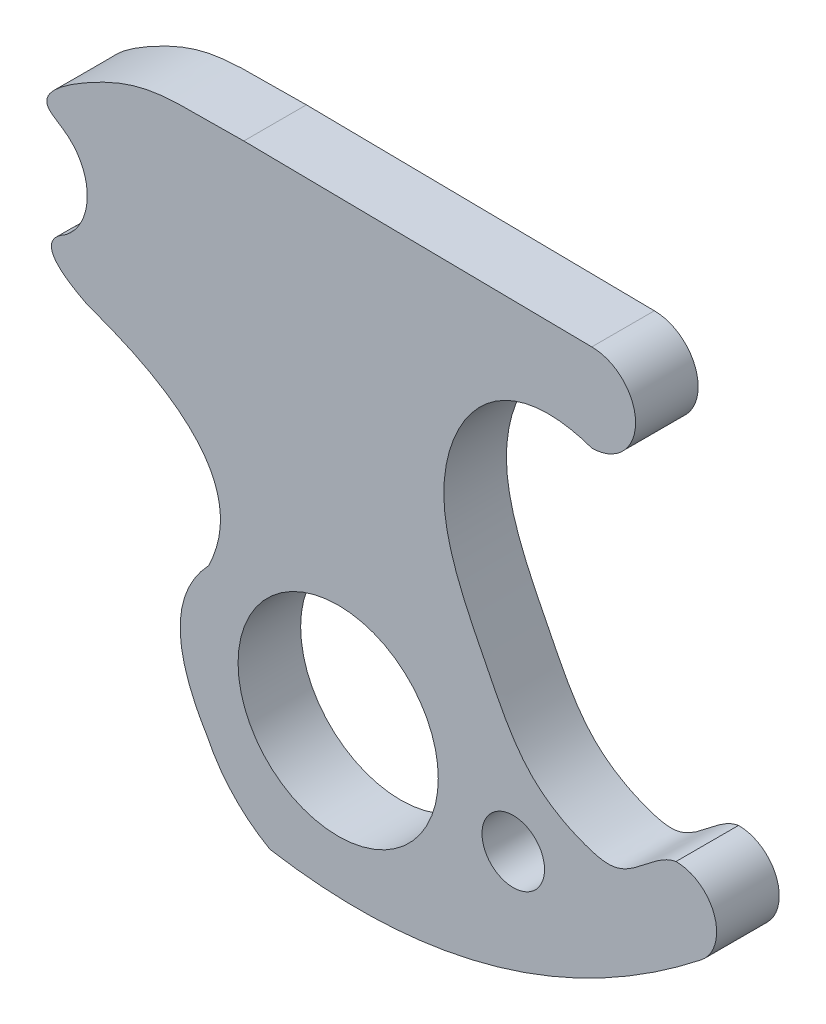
ISO-10303-21;
HEADER;
FILE_DESCRIPTION(('STEP AP214'),'2;1');
FILE_NAME('part.step','',(''),(''),'','','');
FILE_SCHEMA(('AUTOMOTIVE_DESIGN { 1 0 10303 214 1 1 1 1 }'));
ENDSEC;
DATA;
#1=APPLICATION_CONTEXT('core data for automotive mechanical design processes');
#2=APPLICATION_PROTOCOL_DEFINITION('international standard','automotive_design',2000,#1);
#3=PRODUCT_CONTEXT('',#1,'mechanical');
#4=PRODUCT('Part','Part','',(#3));
#5=PRODUCT_RELATED_PRODUCT_CATEGORY('part','',(#4));
#6=PRODUCT_DEFINITION_FORMATION('','',#4);
#7=PRODUCT_DEFINITION_CONTEXT('part definition',#1,'design');
#8=PRODUCT_DEFINITION('design','',#6,#7);
#9=PRODUCT_DEFINITION_SHAPE('','',#8);
#10=(LENGTH_UNIT() NAMED_UNIT(*) SI_UNIT(.MILLI.,.METRE.));
#11=(NAMED_UNIT(*) PLANE_ANGLE_UNIT() SI_UNIT($,.RADIAN.));
#12=(NAMED_UNIT(*) SI_UNIT($,.STERADIAN.) SOLID_ANGLE_UNIT());
#13=UNCERTAINTY_MEASURE_WITH_UNIT(LENGTH_MEASURE(1.E-05),#10,'distance_accuracy_value','');
#14=(GEOMETRIC_REPRESENTATION_CONTEXT(3) GLOBAL_UNCERTAINTY_ASSIGNED_CONTEXT((#13)) GLOBAL_UNIT_ASSIGNED_CONTEXT((#10,
#11,#12)) REPRESENTATION_CONTEXT('',''));
#15=CARTESIAN_POINT('',(0.,0.,0.));
#16=DIRECTION('',(0.,0.,1.));
#17=DIRECTION('',(1.,0.,0.));
#18=AXIS2_PLACEMENT_3D('',#15,#16,#17);
#19=CARTESIAN_POINT('',(-20.7514285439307,33.7227240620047,5.));
#20=DIRECTION('',(0.,0.,-1.));
#21=DIRECTION('',(-1.,0.,0.));
#22=AXIS2_PLACEMENT_3D('',#19,#20,#21);
#23=PLANE('',#22);
#24=CARTESIAN_POINT('',(0.,0.,5.));
#25=DIRECTION('',(0.,0.,1.));
#26=DIRECTION('',(1.,0.,0.));
#27=AXIS2_PLACEMENT_3D('',#24,#25,#26);
#28=CIRCLE('',#27,8.);
#29=CARTESIAN_POINT('',(8.,0.,5.));
#30=VERTEX_POINT('',#29);
#31=EDGE_CURVE('E221',#30,#30,#28,.T.);
#32=ORIENTED_EDGE('',*,*,#31,.F.);
#33=EDGE_LOOP('',(#32));
#34=FACE_BOUND('',#33,.T.);
#35=CARTESIAN_POINT('',(20.2655854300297,36.,5.));
#36=CARTESIAN_POINT('',(-7.53876863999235,36.3506294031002,5.));
#37=B_SPLINE_CURVE_WITH_KNOTS('',1,(#35,#36),.UNSPECIFIED.,.F.,.F.,(2,2),(0.,1.),.UNSPECIFIED.);
#38=CARTESIAN_POINT('',(20.2655854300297,36.,5.));
#39=VERTEX_POINT('',#38);
#40=CARTESIAN_POINT('',(-7.53876863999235,36.3506294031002,5.));
#41=VERTEX_POINT('',#40);
#42=EDGE_CURVE('E208',#39,#41,#37,.T.);
#43=ORIENTED_EDGE('',*,*,#42,.T.);
#44=CARTESIAN_POINT('',(-7.53876863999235,36.3506294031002,5.));
#45=CARTESIAN_POINT('',(-13.2526858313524,36.2026563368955,5.));
#46=CARTESIAN_POINT('',(-15.9308623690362,37.0656871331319,5.));
#47=CARTESIAN_POINT('',(-24.5833501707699,31.2786402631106,5.));
#48=CARTESIAN_POINT('',(-19.440600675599,28.8280088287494,5.));
#49=CARTESIAN_POINT('',(-19.513412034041,24.5035922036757,5.));
#50=CARTESIAN_POINT('',(-21.7529579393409,22.759510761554,5.));
#51=B_SPLINE_CURVE_WITH_KNOTS('',3,(#44,#45,#46,#47,#48,#49,#50),.UNSPECIFIED.,.F.,.F.,(4,1,1,1,
4),(0.,0.477306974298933,0.644600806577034,0.710818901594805,1.),.UNSPECIFIED.);
#52=CARTESIAN_POINT('',(-21.7529579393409,22.759510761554,5.));
#53=VERTEX_POINT('',#52);
#54=EDGE_CURVE('E99',#41,#53,#51,.T.);
#55=ORIENTED_EDGE('',*,*,#54,.T.);
#56=CARTESIAN_POINT('',(-21.7529579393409,22.759510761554,5.));
#57=CARTESIAN_POINT('',(-24.7413724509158,21.1377309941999,5.));
#58=CARTESIAN_POINT('',(-20.0526321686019,18.7686088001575,5.));
#59=B_SPLINE_CURVE_WITH_KNOTS('',2,(#56,#57,#58),.UNSPECIFIED.,.F.,.F.,(3,3),(0.,1.),.UNSPECIFIED.);
#60=CARTESIAN_POINT('',(-20.0526321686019,18.7686088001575,5.));
#61=VERTEX_POINT('',#60);
#62=EDGE_CURVE('E197',#53,#61,#59,.T.);
#63=ORIENTED_EDGE('',*,*,#62,.T.);
#64=CARTESIAN_POINT('',(-20.0526321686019,18.7686088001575,5.));
#65=CARTESIAN_POINT('',(-6.23194443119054,13.9479070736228,5.));
#66=CARTESIAN_POINT('',(-10.3537135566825,5.55269025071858,5.));
#67=B_SPLINE_CURVE_WITH_KNOTS('',2,(#64,#65,#66),.UNSPECIFIED.,.F.,.F.,(3,3),(0.,1.),.UNSPECIFIED.);
#68=CARTESIAN_POINT('',(-10.3537135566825,5.55269025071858,5.));
#69=VERTEX_POINT('',#68);
#70=EDGE_CURVE('E176',#61,#69,#67,.T.);
#71=ORIENTED_EDGE('',*,*,#70,.T.);
#72=CARTESIAN_POINT('',(-10.3537135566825,5.55269025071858,5.));
#73=CARTESIAN_POINT('',(-14.8367710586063,0.798292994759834,5.));
#74=CARTESIAN_POINT('',(-10.4719420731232,-6.29607386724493,5.));
#75=B_SPLINE_CURVE_WITH_KNOTS('',2,(#72,#73,#74),.UNSPECIFIED.,.F.,.F.,(3,3),(0.,1.),.UNSPECIFIED.);
#76=CARTESIAN_POINT('',(-10.4719420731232,-6.29607386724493,5.));
#77=VERTEX_POINT('',#76);
#78=EDGE_CURVE('E171',#69,#77,#75,.T.);
#79=ORIENTED_EDGE('',*,*,#78,.T.);
#80=CARTESIAN_POINT('',(0.500000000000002,-0.999999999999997,5.));
#81=DIRECTION('',(0.,0.,1.));
#82=DIRECTION('',(1.,0.,0.));
#83=AXIS2_PLACEMENT_3D('',#80,#81,#82);
#84=CIRCLE('',#83,12.1832635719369);
#85=CARTESIAN_POINT('',(-5.44066062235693,-11.6367505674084,5.));
#86=VERTEX_POINT('',#85);
#87=EDGE_CURVE('E166',#77,#86,#84,.T.);
#88=ORIENTED_EDGE('',*,*,#87,.T.);
#89=CARTESIAN_POINT('',(-5.44066062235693,-11.6367505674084,5.));
#90=CARTESIAN_POINT('',(12.9558635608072,-14.7021529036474,5.));
#91=CARTESIAN_POINT('',(28.9868345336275,-2.06837865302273,5.));
#92=B_SPLINE_CURVE_WITH_KNOTS('',2,(#89,#90,#91),.UNSPECIFIED.,.F.,.F.,(3,3),(0.,1.),.UNSPECIFIED.);
#93=CARTESIAN_POINT('',(28.9868345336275,-2.06837865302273,5.));
#94=VERTEX_POINT('',#93);
#95=EDGE_CURVE('E124',#86,#94,#92,.T.);
#96=ORIENTED_EDGE('',*,*,#95,.T.);
#97=CARTESIAN_POINT('',(26.9953699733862,0.5,5.));
#98=DIRECTION('',(0.,0.,1.));
#99=DIRECTION('',(1.,0.,0.));
#100=AXIS2_PLACEMENT_3D('',#97,#98,#99);
#101=CIRCLE('',#100,3.25);
#102=CARTESIAN_POINT('',(26.9953699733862,3.75,5.));
#103=VERTEX_POINT('',#102);
#104=EDGE_CURVE('E118',#94,#103,#101,.T.);
#105=ORIENTED_EDGE('',*,*,#104,.T.);
#106=CARTESIAN_POINT('',(26.9953699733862,3.75,5.));
#107=CARTESIAN_POINT('',(25.2656343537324,3.44699120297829,5.));
#108=CARTESIAN_POINT('',(23.2438230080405,0.258914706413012,5.));
#109=CARTESIAN_POINT('',(18.8506980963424,1.4608168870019,5.));
#110=CARTESIAN_POINT('',(14.7677667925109,3.81757658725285,5.));
#111=CARTESIAN_POINT('',(11.3342761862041,10.8582013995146,5.));
#112=CARTESIAN_POINT('',(5.65270933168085,21.587135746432,5.));
#113=CARTESIAN_POINT('',(12.8123683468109,31.6080154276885,5.));
#114=CARTESIAN_POINT('',(20.2655854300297,29.,5.));
#115=B_SPLINE_CURVE_WITH_KNOTS('',3,(#106,#107,#108,#109,#110,#111,#112,#113,#114),
.UNSPECIFIED.,.F.,.F.,(4,1,1,1,1,1,4),(0.,0.121513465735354,0.169898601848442,0.270902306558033,
0.413829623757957,0.654507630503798,1.),.UNSPECIFIED.);
#116=CARTESIAN_POINT('',(20.2655854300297,29.,5.));
#117=VERTEX_POINT('',#116);
#118=EDGE_CURVE('E122',#103,#117,#115,.T.);
#119=ORIENTED_EDGE('',*,*,#118,.T.);
#120=CARTESIAN_POINT('',(20.2655854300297,32.5,5.));
#121=DIRECTION('',(0.,0.,1.));
#122=DIRECTION('',(1.,0.,0.));
#123=AXIS2_PLACEMENT_3D('',#120,#121,#122);
#124=CIRCLE('',#123,3.5);
#125=EDGE_CURVE('E50',#117,#39,#124,.T.);
#126=ORIENTED_EDGE('',*,*,#125,.T.);
#127=EDGE_LOOP('',(#43,#55,#63,#71,#79,#88,#96,#105,#119,#126));
#128=FACE_BOUND('',#127,.T.);
#129=CARTESIAN_POINT('',(13.9913439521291,-2.05968308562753,5.));
#130=DIRECTION('',(0.,0.,1.));
#131=DIRECTION('',(1.,0.,0.));
#132=AXIS2_PLACEMENT_3D('',#129,#130,#131);
#133=CIRCLE('',#132,2.5);
#134=CARTESIAN_POINT('',(16.4913439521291,-2.05968308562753,5.));
#135=VERTEX_POINT('',#134);
#136=EDGE_CURVE('E225',#135,#135,#133,.T.);
#137=ORIENTED_EDGE('',*,*,#136,.F.);
#138=EDGE_LOOP('',(#137));
#139=FACE_BOUND('',#138,.T.);
#140=ADVANCED_FACE('F32',(#34,#128,#139),#23,.F.);
#141=CARTESIAN_POINT('',(-20.7514285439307,33.7227240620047,0.));
#142=DIRECTION('',(0.,0.,-1.));
#143=DIRECTION('',(-1.,0.,0.));
#144=AXIS2_PLACEMENT_3D('',#141,#142,#143);
#145=PLANE('',#144);
#146=CARTESIAN_POINT('',(13.9913439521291,-2.05968308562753,0.));
#147=DIRECTION('',(0.,0.,-1.));
#148=DIRECTION('',(-1.,0.,0.));
#149=AXIS2_PLACEMENT_3D('',#146,#147,#148);
#150=CIRCLE('',#149,2.5);
#151=CARTESIAN_POINT('',(11.4913439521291,-2.05968308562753,0.));
#152=VERTEX_POINT('',#151);
#153=EDGE_CURVE('E36',#152,#152,#150,.T.);
#154=ORIENTED_EDGE('',*,*,#153,.F.);
#155=EDGE_LOOP('',(#154));
#156=FACE_BOUND('',#155,.T.);
#157=CARTESIAN_POINT('',(20.2655854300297,36.,0.));
#158=CARTESIAN_POINT('',(-7.53876863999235,36.3506294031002,0.));
#159=B_SPLINE_CURVE_WITH_KNOTS('',1,(#157,#158),.UNSPECIFIED.,.F.,.F.,(2,2),(0.,1.),.UNSPECIFIED.);
#160=CARTESIAN_POINT('',(20.2655854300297,36.,0.));
#161=VERTEX_POINT('',#160);
#162=CARTESIAN_POINT('',(-7.53876863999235,36.3506294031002,0.));
#163=VERTEX_POINT('',#162);
#164=EDGE_CURVE('E224',#161,#163,#159,.T.);
#165=ORIENTED_EDGE('',*,*,#164,.F.);
#166=CARTESIAN_POINT('',(20.2655854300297,32.5,0.));
#167=DIRECTION('',(0.,0.,1.));
#168=DIRECTION('',(1.,0.,0.));
#169=AXIS2_PLACEMENT_3D('',#166,#167,#168);
#170=CIRCLE('',#169,3.5);
#171=CARTESIAN_POINT('',(20.2655854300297,29.,0.));
#172=VERTEX_POINT('',#171);
#173=EDGE_CURVE('E91',#172,#161,#170,.T.);
#174=ORIENTED_EDGE('',*,*,#173,.F.);
#175=CARTESIAN_POINT('',(26.9953699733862,3.75,0.));
#176=CARTESIAN_POINT('',(25.2656343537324,3.44699120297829,0.));
#177=CARTESIAN_POINT('',(23.2438230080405,0.258914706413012,0.));
#178=CARTESIAN_POINT('',(18.8506980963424,1.4608168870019,0.));
#179=CARTESIAN_POINT('',(14.7677667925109,3.81757658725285,0.));
#180=CARTESIAN_POINT('',(11.3342761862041,10.8582013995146,0.));
#181=CARTESIAN_POINT('',(5.65270933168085,21.587135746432,0.));
#182=CARTESIAN_POINT('',(12.8123683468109,31.6080154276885,0.));
#183=CARTESIAN_POINT('',(20.2655854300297,29.,0.));
#184=B_SPLINE_CURVE_WITH_KNOTS('',3,(#175,#176,#177,#178,#179,#180,#181,#182,#183),
.UNSPECIFIED.,.F.,.F.,(4,1,1,1,1,1,4),(0.,0.121513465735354,0.169898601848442,0.270902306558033,
0.413829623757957,0.654507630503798,1.),.UNSPECIFIED.);
#185=CARTESIAN_POINT('',(26.9953699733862,3.75,0.));
#186=VERTEX_POINT('',#185);
#187=EDGE_CURVE('E85',#186,#172,#184,.T.);
#188=ORIENTED_EDGE('',*,*,#187,.F.);
#189=CARTESIAN_POINT('',(26.9953699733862,0.5,0.));
#190=DIRECTION('',(0.,0.,1.));
#191=DIRECTION('',(1.,0.,0.));
#192=AXIS2_PLACEMENT_3D('',#189,#190,#191);
#193=CIRCLE('',#192,3.25);
#194=CARTESIAN_POINT('',(28.9868345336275,-2.06837865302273,0.));
#195=VERTEX_POINT('',#194);
#196=EDGE_CURVE('E132',#195,#186,#193,.T.);
#197=ORIENTED_EDGE('',*,*,#196,.F.);
#198=CARTESIAN_POINT('',(-5.44066062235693,-11.6367505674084,0.));
#199=CARTESIAN_POINT('',(12.9558635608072,-14.7021529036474,0.));
#200=CARTESIAN_POINT('',(28.9868345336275,-2.06837865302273,0.));
#201=B_SPLINE_CURVE_WITH_KNOTS('',2,(#198,#199,#200),.UNSPECIFIED.,.F.,.F.,(3,3),(0.,1.),.UNSPECIFIED.);
#202=CARTESIAN_POINT('',(-5.44066062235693,-11.6367505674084,0.));
#203=VERTEX_POINT('',#202);
#204=EDGE_CURVE('E353',#203,#195,#201,.T.);
#205=ORIENTED_EDGE('',*,*,#204,.F.);
#206=CARTESIAN_POINT('',(0.500000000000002,-0.999999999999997,0.));
#207=DIRECTION('',(0.,0.,1.));
#208=DIRECTION('',(1.,0.,0.));
#209=AXIS2_PLACEMENT_3D('',#206,#207,#208);
#210=CIRCLE('',#209,12.1832635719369);
#211=CARTESIAN_POINT('',(-10.4719420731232,-6.29607386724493,0.));
#212=VERTEX_POINT('',#211);
#213=EDGE_CURVE('E345',#212,#203,#210,.T.);
#214=ORIENTED_EDGE('',*,*,#213,.F.);
#215=CARTESIAN_POINT('',(-10.3537135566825,5.55269025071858,0.));
#216=CARTESIAN_POINT('',(-14.8367710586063,0.798292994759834,0.));
#217=CARTESIAN_POINT('',(-10.4719420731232,-6.29607386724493,0.));
#218=B_SPLINE_CURVE_WITH_KNOTS('',2,(#215,#216,#217),.UNSPECIFIED.,.F.,.F.,(3,3),(0.,1.),.UNSPECIFIED.);
#219=CARTESIAN_POINT('',(-10.3537135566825,5.55269025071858,0.));
#220=VERTEX_POINT('',#219);
#221=EDGE_CURVE('E354',#220,#212,#218,.T.);
#222=ORIENTED_EDGE('',*,*,#221,.F.);
#223=CARTESIAN_POINT('',(-20.0526321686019,18.7686088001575,0.));
#224=CARTESIAN_POINT('',(-6.23194443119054,13.9479070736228,0.));
#225=CARTESIAN_POINT('',(-10.3537135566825,5.55269025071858,0.));
#226=B_SPLINE_CURVE_WITH_KNOTS('',2,(#223,#224,#225),.UNSPECIFIED.,.F.,.F.,(3,3),(0.,1.),.UNSPECIFIED.);
#227=CARTESIAN_POINT('',(-20.0526321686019,18.7686088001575,0.));
#228=VERTEX_POINT('',#227);
#229=EDGE_CURVE('E390',#228,#220,#226,.T.);
#230=ORIENTED_EDGE('',*,*,#229,.F.);
#231=CARTESIAN_POINT('',(-21.7529579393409,22.759510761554,0.));
#232=CARTESIAN_POINT('',(-24.7413724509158,21.1377309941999,0.));
#233=CARTESIAN_POINT('',(-20.0526321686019,18.7686088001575,0.));
#234=B_SPLINE_CURVE_WITH_KNOTS('',2,(#231,#232,#233),.UNSPECIFIED.,.F.,.F.,(3,3),(0.,1.),.UNSPECIFIED.);
#235=CARTESIAN_POINT('',(-21.7529579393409,22.759510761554,0.));
#236=VERTEX_POINT('',#235);
#237=EDGE_CURVE('E387',#236,#228,#234,.T.);
#238=ORIENTED_EDGE('',*,*,#237,.F.);
#239=CARTESIAN_POINT('',(-7.53876863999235,36.3506294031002,0.));
#240=CARTESIAN_POINT('',(-13.2526858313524,36.2026563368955,0.));
#241=CARTESIAN_POINT('',(-15.9308623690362,37.0656871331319,0.));
#242=CARTESIAN_POINT('',(-24.5833501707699,31.2786402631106,0.));
#243=CARTESIAN_POINT('',(-19.440600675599,28.8280088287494,0.));
#244=CARTESIAN_POINT('',(-19.513412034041,24.5035922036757,0.));
#245=CARTESIAN_POINT('',(-21.7529579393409,22.759510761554,0.));
#246=B_SPLINE_CURVE_WITH_KNOTS('',3,(#239,#240,#241,#242,#243,#244,#245),.UNSPECIFIED.,.F.,.F.,
(4,1,1,1,4),(0.,0.477306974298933,0.644600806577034,0.710818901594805,1.),.UNSPECIFIED.);
#247=EDGE_CURVE('E389',#163,#236,#246,.T.);
#248=ORIENTED_EDGE('',*,*,#247,.F.);
#249=EDGE_LOOP('',(#165,#174,#188,#197,#205,#214,#222,#230,#238,#248));
#250=FACE_BOUND('',#249,.T.);
#251=CARTESIAN_POINT('',(0.,0.,0.));
#252=DIRECTION('',(0.,0.,1.));
#253=DIRECTION('',(1.,0.,0.));
#254=AXIS2_PLACEMENT_3D('',#251,#252,#253);
#255=CIRCLE('',#254,8.);
#256=CARTESIAN_POINT('',(8.,0.,0.));
#257=VERTEX_POINT('',#256);
#258=EDGE_CURVE('E215',#257,#257,#255,.T.);
#259=ORIENTED_EDGE('',*,*,#258,.T.);
#260=EDGE_LOOP('',(#259));
#261=FACE_BOUND('',#260,.T.);
#262=ADVANCED_FACE('F234',(#156,#250,#261),#145,.T.);
#263=CARTESIAN_POINT('',(20.2655854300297,36.,5.));
#264=DIRECTION('',(-0.0126095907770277,-0.999920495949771,0.));
#265=DIRECTION('',(0.999920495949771,-0.0126095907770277,0.));
#266=AXIS2_PLACEMENT_3D('',#263,#264,#265);
#267=PLANE('',#266);
#268=ORIENTED_EDGE('',*,*,#164,.T.);
#269=DIRECTION('',(0.,0.,-1.));
#270=VECTOR('',#269,1.);
#271=CARTESIAN_POINT('',(-7.53876863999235,36.3506294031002,5.));
#272=LINE('',#271,#270);
#273=EDGE_CURVE('E11',#41,#163,#272,.T.);
#274=ORIENTED_EDGE('',*,*,#273,.F.);
#275=ORIENTED_EDGE('',*,*,#42,.F.);
#276=DIRECTION('',(0.,0.,-1.));
#277=VECTOR('',#276,1.);
#278=CARTESIAN_POINT('',(20.2655854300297,36.,5.));
#279=LINE('',#278,#277);
#280=EDGE_CURVE('E138',#39,#161,#279,.T.);
#281=ORIENTED_EDGE('',*,*,#280,.T.);
#282=EDGE_LOOP('',(#268,#274,#275,#281));
#283=FACE_BOUND('',#282,.T.);
#284=ADVANCED_FACE('F34',(#283),#267,.F.);
#285=DIRECTION('',(0.,0.,-1.));
#286=VECTOR('',#285,1.);
#287=SURFACE_OF_LINEAR_EXTRUSION('',#51,#286);
#288=ORIENTED_EDGE('',*,*,#247,.T.);
#289=DIRECTION('',(0.,0.,-1.));
#290=VECTOR('',#289,1.);
#291=CARTESIAN_POINT('',(-21.7529579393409,22.759510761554,5.));
#292=LINE('',#291,#290);
#293=EDGE_CURVE('E42',#53,#236,#292,.T.);
#294=ORIENTED_EDGE('',*,*,#293,.F.);
#295=ORIENTED_EDGE('',*,*,#54,.F.);
#296=ORIENTED_EDGE('',*,*,#273,.T.);
#297=EDGE_LOOP('',(#288,#294,#295,#296));
#298=FACE_BOUND('',#297,.T.);
#299=ADVANCED_FACE('F194',(#298),#287,.F.);
#300=DIRECTION('',(0.,0.,-1.));
#301=VECTOR('',#300,1.);
#302=SURFACE_OF_LINEAR_EXTRUSION('',#59,#301);
#303=ORIENTED_EDGE('',*,*,#237,.T.);
#304=DIRECTION('',(0.,0.,-1.));
#305=VECTOR('',#304,1.);
#306=CARTESIAN_POINT('',(-20.0526321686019,18.7686088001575,5.));
#307=LINE('',#306,#305);
#308=EDGE_CURVE('E380',#61,#228,#307,.T.);
#309=ORIENTED_EDGE('',*,*,#308,.F.);
#310=ORIENTED_EDGE('',*,*,#62,.F.);
#311=ORIENTED_EDGE('',*,*,#293,.T.);
#312=EDGE_LOOP('',(#303,#309,#310,#311));
#313=FACE_BOUND('',#312,.T.);
#314=ADVANCED_FACE('F191',(#313),#302,.F.);
#315=DIRECTION('',(0.,0.,-1.));
#316=VECTOR('',#315,1.);
#317=SURFACE_OF_LINEAR_EXTRUSION('',#67,#316);
#318=ORIENTED_EDGE('',*,*,#229,.T.);
#319=DIRECTION('',(0.,0.,-1.));
#320=VECTOR('',#319,1.);
#321=CARTESIAN_POINT('',(-10.3537135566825,5.55269025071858,5.));
#322=LINE('',#321,#320);
#323=EDGE_CURVE('E377',#69,#220,#322,.T.);
#324=ORIENTED_EDGE('',*,*,#323,.F.);
#325=ORIENTED_EDGE('',*,*,#70,.F.);
#326=ORIENTED_EDGE('',*,*,#308,.T.);
#327=EDGE_LOOP('',(#318,#324,#325,#326));
#328=FACE_BOUND('',#327,.T.);
#329=ADVANCED_FACE('F187',(#328),#317,.F.);
#330=DIRECTION('',(0.,0.,-1.));
#331=VECTOR('',#330,1.);
#332=SURFACE_OF_LINEAR_EXTRUSION('',#75,#331);
#333=ORIENTED_EDGE('',*,*,#221,.T.);
#334=DIRECTION('',(0.,0.,-1.));
#335=VECTOR('',#334,1.);
#336=CARTESIAN_POINT('',(-10.4719420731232,-6.29607386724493,5.));
#337=LINE('',#336,#335);
#338=EDGE_CURVE('E350',#77,#212,#337,.T.);
#339=ORIENTED_EDGE('',*,*,#338,.F.);
#340=ORIENTED_EDGE('',*,*,#78,.F.);
#341=ORIENTED_EDGE('',*,*,#323,.T.);
#342=EDGE_LOOP('',(#333,#339,#340,#341));
#343=FACE_BOUND('',#342,.T.);
#344=ADVANCED_FACE('F184',(#343),#332,.F.);
#345=CARTESIAN_POINT('',(0.500000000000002,-0.999999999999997,5.));
#346=DIRECTION('',(0.,0.,-1.));
#347=DIRECTION('',(-1.,0.,0.));
#348=AXIS2_PLACEMENT_3D('',#345,#346,#347);
#349=CYLINDRICAL_SURFACE('',#348,12.1832635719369);
#350=ORIENTED_EDGE('',*,*,#213,.T.);
#351=DIRECTION('',(0.,0.,-1.));
#352=VECTOR('',#351,1.);
#353=CARTESIAN_POINT('',(-5.44066062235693,-11.6367505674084,5.));
#354=LINE('',#353,#352);
#355=EDGE_CURVE('E348',#86,#203,#354,.T.);
#356=ORIENTED_EDGE('',*,*,#355,.F.);
#357=ORIENTED_EDGE('',*,*,#87,.F.);
#358=ORIENTED_EDGE('',*,*,#338,.T.);
#359=EDGE_LOOP('',(#350,#356,#357,#358));
#360=FACE_BOUND('',#359,.T.);
#361=ADVANCED_FACE('F159',(#360),#349,.T.);
#362=DIRECTION('',(0.,0.,-1.));
#363=VECTOR('',#362,1.);
#364=SURFACE_OF_LINEAR_EXTRUSION('',#92,#363);
#365=ORIENTED_EDGE('',*,*,#204,.T.);
#366=DIRECTION('',(0.,0.,-1.));
#367=VECTOR('',#366,1.);
#368=CARTESIAN_POINT('',(28.9868345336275,-2.06837865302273,5.));
#369=LINE('',#368,#367);
#370=EDGE_CURVE('E133',#94,#195,#369,.T.);
#371=ORIENTED_EDGE('',*,*,#370,.F.);
#372=ORIENTED_EDGE('',*,*,#95,.F.);
#373=ORIENTED_EDGE('',*,*,#355,.T.);
#374=EDGE_LOOP('',(#365,#371,#372,#373));
#375=FACE_BOUND('',#374,.T.);
#376=ADVANCED_FACE('F156',(#375),#364,.F.);
#377=CARTESIAN_POINT('',(26.9953699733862,0.5,5.));
#378=DIRECTION('',(0.,0.,-1.));
#379=DIRECTION('',(-1.,0.,0.));
#380=AXIS2_PLACEMENT_3D('',#377,#378,#379);
#381=CYLINDRICAL_SURFACE('',#380,3.25);
#382=ORIENTED_EDGE('',*,*,#196,.T.);
#383=DIRECTION('',(0.,0.,-1.));
#384=VECTOR('',#383,1.);
#385=CARTESIAN_POINT('',(26.9953699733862,3.75,5.));
#386=LINE('',#385,#384);
#387=EDGE_CURVE('E129',#103,#186,#386,.T.);
#388=ORIENTED_EDGE('',*,*,#387,.F.);
#389=ORIENTED_EDGE('',*,*,#104,.F.);
#390=ORIENTED_EDGE('',*,*,#370,.T.);
#391=EDGE_LOOP('',(#382,#388,#389,#390));
#392=FACE_BOUND('',#391,.T.);
#393=ADVANCED_FACE('F130',(#392),#381,.T.);
#394=DIRECTION('',(0.,0.,-1.));
#395=VECTOR('',#394,1.);
#396=SURFACE_OF_LINEAR_EXTRUSION('',#115,#395);
#397=ORIENTED_EDGE('',*,*,#187,.T.);
#398=DIRECTION('',(0.,0.,-1.));
#399=VECTOR('',#398,1.);
#400=CARTESIAN_POINT('',(20.2655854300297,29.,5.));
#401=LINE('',#400,#399);
#402=EDGE_CURVE('E134',#117,#172,#401,.T.);
#403=ORIENTED_EDGE('',*,*,#402,.F.);
#404=ORIENTED_EDGE('',*,*,#118,.F.);
#405=ORIENTED_EDGE('',*,*,#387,.T.);
#406=EDGE_LOOP('',(#397,#403,#404,#405));
#407=FACE_BOUND('',#406,.T.);
#408=ADVANCED_FACE('F136',(#407),#396,.F.);
#409=CARTESIAN_POINT('',(20.2655854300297,32.5,5.));
#410=DIRECTION('',(0.,0.,-1.));
#411=DIRECTION('',(-1.,0.,0.));
#412=AXIS2_PLACEMENT_3D('',#409,#410,#411);
#413=CYLINDRICAL_SURFACE('',#412,3.5);
#414=ORIENTED_EDGE('',*,*,#173,.T.);
#415=ORIENTED_EDGE('',*,*,#280,.F.);
#416=ORIENTED_EDGE('',*,*,#125,.F.);
#417=ORIENTED_EDGE('',*,*,#402,.T.);
#418=EDGE_LOOP('',(#414,#415,#416,#417));
#419=FACE_BOUND('',#418,.T.);
#420=ADVANCED_FACE('F152',(#419),#413,.T.);
#421=CARTESIAN_POINT('',(0.,0.,5.));
#422=DIRECTION('',(0.,0.,-1.));
#423=DIRECTION('',(-1.,0.,0.));
#424=AXIS2_PLACEMENT_3D('',#421,#422,#423);
#425=CYLINDRICAL_SURFACE('',#424,8.);
#426=ORIENTED_EDGE('',*,*,#31,.T.);
#427=EDGE_LOOP('',(#426));
#428=FACE_BOUND('',#427,.T.);
#429=ORIENTED_EDGE('',*,*,#258,.F.);
#430=EDGE_LOOP('',(#429));
#431=FACE_BOUND('',#430,.T.);
#432=ADVANCED_FACE('F242',(#428,#431),#425,.F.);
#433=CARTESIAN_POINT('',(13.9913439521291,-2.05968308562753,5.));
#434=DIRECTION('',(0.,0.,1.));
#435=DIRECTION('',(1.,0.,0.));
#436=AXIS2_PLACEMENT_3D('',#433,#434,#435);
#437=CYLINDRICAL_SURFACE('',#436,2.5);
#438=ORIENTED_EDGE('',*,*,#153,.T.);
#439=EDGE_LOOP('',(#438));
#440=FACE_BOUND('',#439,.T.);
#441=ORIENTED_EDGE('',*,*,#136,.T.);
#442=EDGE_LOOP('',(#441));
#443=FACE_BOUND('',#442,.T.);
#444=ADVANCED_FACE('F232',(#440,#443),#437,.F.);
#445=CLOSED_SHELL('',(#140,#262,#284,#299,#314,#329,#344,#361,#376,#393,#408,#420,#432,#444));
#446=MANIFOLD_SOLID_BREP('B2',#445);
#447=ADVANCED_BREP_SHAPE_REPRESENTATION('',(#18,#446),#14);
#448=SHAPE_DEFINITION_REPRESENTATION(#9,#447);
ENDSEC;
END-ISO-10303-21;
